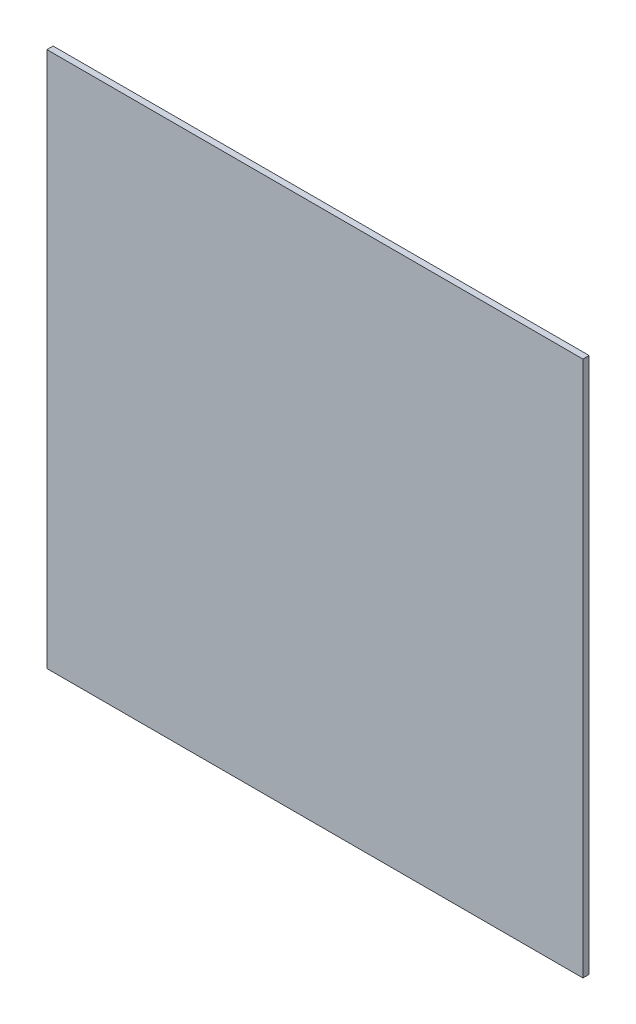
ISO-10303-21;
HEADER;
FILE_DESCRIPTION(('STEP AP214'),'2;1');
FILE_NAME('part.step','',(''),(''),'','','');
FILE_SCHEMA(('AUTOMOTIVE_DESIGN { 1 0 10303 214 1 1 1 1 }'));
ENDSEC;
DATA;
#1=APPLICATION_CONTEXT('core data for automotive mechanical design processes');
#2=APPLICATION_PROTOCOL_DEFINITION('international standard','automotive_design',2000,#1);
#3=PRODUCT_CONTEXT('',#1,'mechanical');
#4=PRODUCT('Part','Part','',(#3));
#5=PRODUCT_RELATED_PRODUCT_CATEGORY('part','',(#4));
#6=PRODUCT_DEFINITION_FORMATION('','',#4);
#7=PRODUCT_DEFINITION_CONTEXT('part definition',#1,'design');
#8=PRODUCT_DEFINITION('design','',#6,#7);
#9=PRODUCT_DEFINITION_SHAPE('','',#8);
#10=(LENGTH_UNIT() NAMED_UNIT(*) SI_UNIT(.MILLI.,.METRE.));
#11=(NAMED_UNIT(*) PLANE_ANGLE_UNIT() SI_UNIT($,.RADIAN.));
#12=(NAMED_UNIT(*) SI_UNIT($,.STERADIAN.) SOLID_ANGLE_UNIT());
#13=UNCERTAINTY_MEASURE_WITH_UNIT(LENGTH_MEASURE(1.E-05),#10,'distance_accuracy_value','');
#14=(GEOMETRIC_REPRESENTATION_CONTEXT(3) GLOBAL_UNCERTAINTY_ASSIGNED_CONTEXT((#13)) GLOBAL_UNIT_ASSIGNED_CONTEXT((#10,
#11,#12)) REPRESENTATION_CONTEXT('',''));
#15=CARTESIAN_POINT('',(0.,0.,0.));
#16=DIRECTION('',(0.,0.,1.));
#17=DIRECTION('',(1.,0.,0.));
#18=AXIS2_PLACEMENT_3D('',#15,#16,#17);
#19=CARTESIAN_POINT('',(129.8,-129.8,3.));
#20=DIRECTION('',(-1.,0.,0.));
#21=DIRECTION('',(0.,0.,1.));
#22=AXIS2_PLACEMENT_3D('',#19,#20,#21);
#23=PLANE('',#22);
#24=DIRECTION('',(0.,1.,0.));
#25=VECTOR('',#24,1.);
#26=CARTESIAN_POINT('',(129.8,-129.8,0.));
#27=LINE('',#26,#25);
#28=CARTESIAN_POINT('',(129.8,-129.8,0.));
#29=VERTEX_POINT('',#28);
#30=CARTESIAN_POINT('',(129.8,129.8,0.));
#31=VERTEX_POINT('',#30);
#32=EDGE_CURVE('E95',#29,#31,#27,.T.);
#33=ORIENTED_EDGE('',*,*,#32,.T.);
#34=DIRECTION('',(0.,0.,-1.));
#35=VECTOR('',#34,1.);
#36=CARTESIAN_POINT('',(129.8,129.8,3.));
#37=LINE('',#36,#35);
#38=CARTESIAN_POINT('',(129.8,129.8,3.));
#39=VERTEX_POINT('',#38);
#40=EDGE_CURVE('E11',#39,#31,#37,.T.);
#41=ORIENTED_EDGE('',*,*,#40,.F.);
#42=DIRECTION('',(0.,1.,0.));
#43=VECTOR('',#42,1.);
#44=CARTESIAN_POINT('',(129.8,-129.8,3.));
#45=LINE('',#44,#43);
#46=CARTESIAN_POINT('',(129.8,-129.8,3.));
#47=VERTEX_POINT('',#46);
#48=EDGE_CURVE('E83',#47,#39,#45,.T.);
#49=ORIENTED_EDGE('',*,*,#48,.F.);
#50=DIRECTION('',(0.,0.,-1.));
#51=VECTOR('',#50,1.);
#52=CARTESIAN_POINT('',(129.8,-129.8,3.));
#53=LINE('',#52,#51);
#54=EDGE_CURVE('E91',#47,#29,#53,.T.);
#55=ORIENTED_EDGE('',*,*,#54,.T.);
#56=EDGE_LOOP('',(#33,#41,#49,#55));
#57=FACE_BOUND('',#56,.T.);
#58=ADVANCED_FACE('F32',(#57),#23,.F.);
#59=CARTESIAN_POINT('',(-129.8,129.8,3.));
#60=DIRECTION('',(0.,-1.,0.));
#61=DIRECTION('',(0.,0.,-1.));
#62=AXIS2_PLACEMENT_3D('',#59,#60,#61);
#63=PLANE('',#62);
#64=DIRECTION('',(-1.,0.,0.));
#65=VECTOR('',#64,1.);
#66=CARTESIAN_POINT('',(-129.8,129.8,0.));
#67=LINE('',#66,#65);
#68=CARTESIAN_POINT('',(-129.8,129.8,0.));
#69=VERTEX_POINT('',#68);
#70=EDGE_CURVE('E87',#31,#69,#67,.T.);
#71=ORIENTED_EDGE('',*,*,#70,.T.);
#72=DIRECTION('',(0.,0.,-1.));
#73=VECTOR('',#72,1.);
#74=CARTESIAN_POINT('',(-129.8,129.8,3.));
#75=LINE('',#74,#73);
#76=CARTESIAN_POINT('',(-129.8,129.8,3.));
#77=VERTEX_POINT('',#76);
#78=EDGE_CURVE('E40',#77,#69,#75,.T.);
#79=ORIENTED_EDGE('',*,*,#78,.F.);
#80=DIRECTION('',(-1.,0.,0.));
#81=VECTOR('',#80,1.);
#82=CARTESIAN_POINT('',(-129.8,129.8,3.));
#83=LINE('',#82,#81);
#84=EDGE_CURVE('E78',#39,#77,#83,.T.);
#85=ORIENTED_EDGE('',*,*,#84,.F.);
#86=ORIENTED_EDGE('',*,*,#40,.T.);
#87=EDGE_LOOP('',(#71,#79,#85,#86));
#88=FACE_BOUND('',#87,.T.);
#89=ADVANCED_FACE('F86',(#88),#63,.F.);
#90=CARTESIAN_POINT('',(-129.8,-129.8,3.));
#91=DIRECTION('',(1.,0.,0.));
#92=DIRECTION('',(0.,0.,-1.));
#93=AXIS2_PLACEMENT_3D('',#90,#91,#92);
#94=PLANE('',#93);
#95=DIRECTION('',(0.,-1.,0.));
#96=VECTOR('',#95,1.);
#97=CARTESIAN_POINT('',(-129.8,-129.8,0.));
#98=LINE('',#97,#96);
#99=CARTESIAN_POINT('',(-129.8,-129.8,0.));
#100=VERTEX_POINT('',#99);
#101=EDGE_CURVE('E65',#69,#100,#98,.T.);
#102=ORIENTED_EDGE('',*,*,#101,.T.);
#103=DIRECTION('',(0.,0.,-1.));
#104=VECTOR('',#103,1.);
#105=CARTESIAN_POINT('',(-129.8,-129.8,3.));
#106=LINE('',#105,#104);
#107=CARTESIAN_POINT('',(-129.8,-129.8,3.));
#108=VERTEX_POINT('',#107);
#109=EDGE_CURVE('E88',#108,#100,#106,.T.);
#110=ORIENTED_EDGE('',*,*,#109,.F.);
#111=DIRECTION('',(0.,-1.,0.));
#112=VECTOR('',#111,1.);
#113=CARTESIAN_POINT('',(-129.8,-129.8,3.));
#114=LINE('',#113,#112);
#115=EDGE_CURVE('E81',#77,#108,#114,.T.);
#116=ORIENTED_EDGE('',*,*,#115,.F.);
#117=ORIENTED_EDGE('',*,*,#78,.T.);
#118=EDGE_LOOP('',(#102,#110,#116,#117));
#119=FACE_BOUND('',#118,.T.);
#120=ADVANCED_FACE('F89',(#119),#94,.F.);
#121=CARTESIAN_POINT('',(-129.8,-129.8,3.));
#122=DIRECTION('',(0.,1.,0.));
#123=DIRECTION('',(0.,0.,1.));
#124=AXIS2_PLACEMENT_3D('',#121,#122,#123);
#125=PLANE('',#124);
#126=DIRECTION('',(1.,0.,0.));
#127=VECTOR('',#126,1.);
#128=CARTESIAN_POINT('',(-129.8,-129.8,0.));
#129=LINE('',#128,#127);
#130=EDGE_CURVE('E71',#100,#29,#129,.T.);
#131=ORIENTED_EDGE('',*,*,#130,.T.);
#132=ORIENTED_EDGE('',*,*,#54,.F.);
#133=DIRECTION('',(1.,0.,0.));
#134=VECTOR('',#133,1.);
#135=CARTESIAN_POINT('',(-129.8,-129.8,3.));
#136=LINE('',#135,#134);
#137=EDGE_CURVE('E48',#108,#47,#136,.T.);
#138=ORIENTED_EDGE('',*,*,#137,.F.);
#139=ORIENTED_EDGE('',*,*,#109,.T.);
#140=EDGE_LOOP('',(#131,#132,#138,#139));
#141=FACE_BOUND('',#140,.T.);
#142=ADVANCED_FACE('F102',(#141),#125,.F.);
#143=CARTESIAN_POINT('',(0.,0.,3.));
#144=DIRECTION('',(0.,0.,-1.));
#145=DIRECTION('',(-1.,0.,0.));
#146=AXIS2_PLACEMENT_3D('',#143,#144,#145);
#147=PLANE('',#146);
#148=ORIENTED_EDGE('',*,*,#48,.T.);
#149=ORIENTED_EDGE('',*,*,#84,.T.);
#150=ORIENTED_EDGE('',*,*,#115,.T.);
#151=ORIENTED_EDGE('',*,*,#137,.T.);
#152=EDGE_LOOP('',(#148,#149,#150,#151));
#153=FACE_BOUND('',#152,.T.);
#154=ADVANCED_FACE('F79',(#153),#147,.F.);
#155=CARTESIAN_POINT('',(0.,0.,0.));
#156=DIRECTION('',(0.,0.,-1.));
#157=DIRECTION('',(-1.,0.,0.));
#158=AXIS2_PLACEMENT_3D('',#155,#156,#157);
#159=PLANE('',#158);
#160=ORIENTED_EDGE('',*,*,#32,.F.);
#161=ORIENTED_EDGE('',*,*,#130,.F.);
#162=ORIENTED_EDGE('',*,*,#101,.F.);
#163=ORIENTED_EDGE('',*,*,#70,.F.);
#164=EDGE_LOOP('',(#160,#161,#162,#163));
#165=FACE_BOUND('',#164,.T.);
#166=ADVANCED_FACE('F105',(#165),#159,.T.);
#167=CLOSED_SHELL('',(#58,#89,#120,#142,#154,#166));
#168=MANIFOLD_SOLID_BREP('B2',#167);
#169=ADVANCED_BREP_SHAPE_REPRESENTATION('',(#18,#168),#14);
#170=SHAPE_DEFINITION_REPRESENTATION(#9,#169);
ENDSEC;
END-ISO-10303-21;
